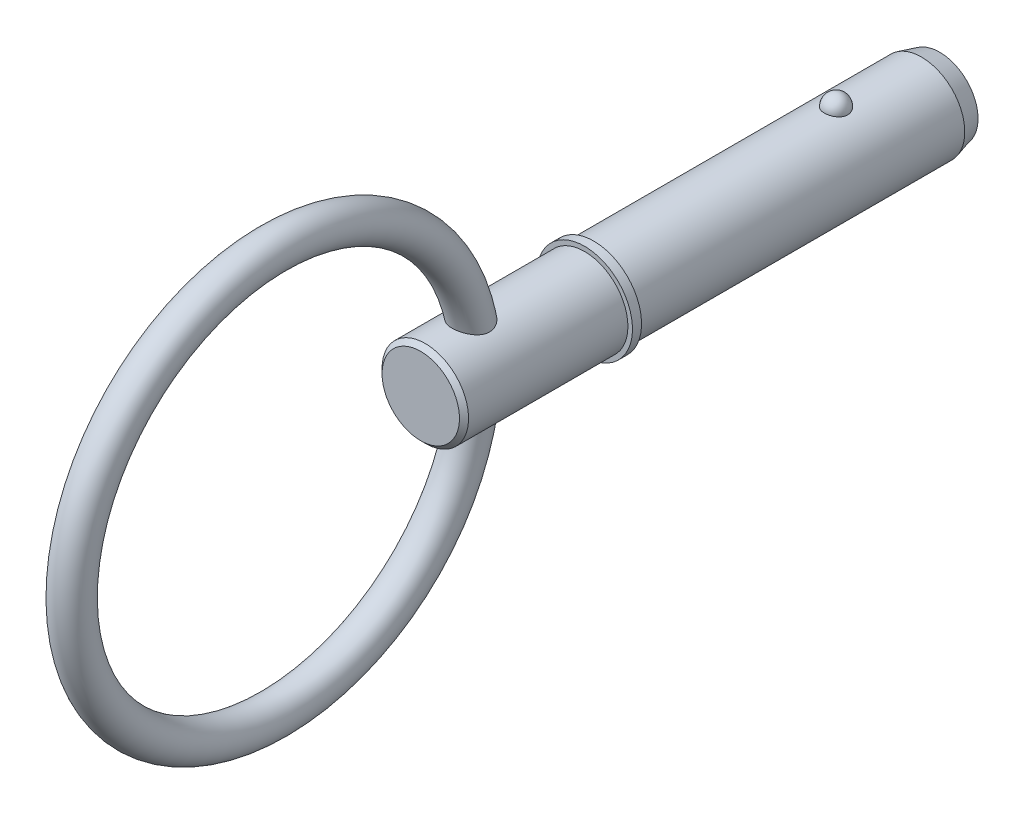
ISO-10303-21;
HEADER;
FILE_DESCRIPTION(('STEP AP214'),'2;1');
FILE_NAME('part.step','',(''),(''),'','','');
FILE_SCHEMA(('AUTOMOTIVE_DESIGN { 1 0 10303 214 1 1 1 1 }'));
ENDSEC;
DATA;
#1=APPLICATION_CONTEXT('core data for automotive mechanical design processes');
#2=APPLICATION_PROTOCOL_DEFINITION('international standard','automotive_design',2000,#1);
#3=PRODUCT_CONTEXT('',#1,'mechanical');
#4=PRODUCT('Part','Part','',(#3));
#5=PRODUCT_RELATED_PRODUCT_CATEGORY('part','',(#4));
#6=PRODUCT_DEFINITION_FORMATION('','',#4);
#7=PRODUCT_DEFINITION_CONTEXT('part definition',#1,'design');
#8=PRODUCT_DEFINITION('design','',#6,#7);
#9=PRODUCT_DEFINITION_SHAPE('','',#8);
#10=(LENGTH_UNIT() NAMED_UNIT(*) SI_UNIT(.MILLI.,.METRE.));
#11=(NAMED_UNIT(*) PLANE_ANGLE_UNIT() SI_UNIT($,.RADIAN.));
#12=(NAMED_UNIT(*) SI_UNIT($,.STERADIAN.) SOLID_ANGLE_UNIT());
#13=UNCERTAINTY_MEASURE_WITH_UNIT(LENGTH_MEASURE(1.E-05),#10,'distance_accuracy_value','');
#14=(GEOMETRIC_REPRESENTATION_CONTEXT(3) GLOBAL_UNCERTAINTY_ASSIGNED_CONTEXT((#13)) GLOBAL_UNIT_ASSIGNED_CONTEXT((#10,
#11,#12)) REPRESENTATION_CONTEXT('',''));
#15=CARTESIAN_POINT('',(0.,0.,0.));
#16=DIRECTION('',(0.,0.,1.));
#17=DIRECTION('',(1.,0.,0.));
#18=AXIS2_PLACEMENT_3D('',#15,#16,#17);
#19=CARTESIAN_POINT('',(0.,0.,25.4));
#20=DIRECTION('',(0.,0.,-1.));
#21=DIRECTION('',(-1.,0.,0.));
#22=AXIS2_PLACEMENT_3D('',#19,#20,#21);
#23=CYLINDRICAL_SURFACE('',#22,4.765);
#24=CARTESIAN_POINT('',(1.27812710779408,4.59038300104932,-1.29));
#25=CARTESIAN_POINT('',(1.27812572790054,4.59038414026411,-1.2178688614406));
#26=CARTESIAN_POINT('',(1.27223018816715,4.59203736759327,-1.14572000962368));
#27=CARTESIAN_POINT('',(1.24878929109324,4.59846646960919,-1.00346315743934));
#28=CARTESIAN_POINT('',(1.23123896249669,4.60324367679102,-0.933356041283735));
#29=CARTESIAN_POINT('',(1.18493861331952,4.61537801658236,-0.797215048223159));
#30=CARTESIAN_POINT('',(1.15619354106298,4.62273400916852,-0.731179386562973));
#31=CARTESIAN_POINT('',(1.08822596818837,4.6392032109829,-0.604986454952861));
#32=CARTESIAN_POINT('',(1.04900384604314,4.64831635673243,-0.544828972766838));
#33=CARTESIAN_POINT('',(0.960865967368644,4.66733302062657,-0.431775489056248));
#34=CARTESIAN_POINT('',(0.911906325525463,4.67723999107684,-0.378914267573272));
#35=CARTESIAN_POINT('',(0.805678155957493,4.69670280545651,-0.282245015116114));
#36=CARTESIAN_POINT('',(0.748409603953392,4.70625864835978,-0.238437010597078));
#37=CARTESIAN_POINT('',(0.627266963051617,4.72392767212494,-0.161207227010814));
#38=CARTESIAN_POINT('',(0.563411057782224,4.73204466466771,-0.127757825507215));
#39=CARTESIAN_POINT('',(0.430755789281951,4.74595788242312,-0.0720471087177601));
#40=CARTESIAN_POINT('',(0.361956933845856,4.75175434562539,-0.0497846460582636));
#41=CARTESIAN_POINT('',(0.222605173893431,4.76030056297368,-0.0173750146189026));
#42=CARTESIAN_POINT('',(0.152101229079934,4.76309991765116,-0.00703038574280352));
#43=CARTESIAN_POINT('',(0.0103009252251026,4.76551622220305,0.00191361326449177));
#44=CARTESIAN_POINT('',(-0.0609953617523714,4.76513345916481,0.00051404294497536));
#45=CARTESIAN_POINT('',(-0.201348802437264,4.76125496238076,-0.0138891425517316));
#46=CARTESIAN_POINT('',(-0.270423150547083,4.75780093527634,-0.026737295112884));
#47=CARTESIAN_POINT('',(-0.405377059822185,4.74820737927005,-0.0634598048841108));
#48=CARTESIAN_POINT('',(-0.471256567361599,4.74206780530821,-0.087334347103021));
#49=CARTESIAN_POINT('',(-0.598375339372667,4.72771507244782,-0.145611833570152));
#50=CARTESIAN_POINT('',(-0.659587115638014,4.71949070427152,-0.180071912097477));
#51=CARTESIAN_POINT('',(-0.775356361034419,4.70185936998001,-0.258542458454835));
#52=CARTESIAN_POINT('',(-0.8299131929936,4.69245229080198,-0.302553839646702));
#53=CARTESIAN_POINT('',(-0.931895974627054,4.67327936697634,-0.399829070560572));
#54=CARTESIAN_POINT('',(-0.979176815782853,4.66351011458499,-0.453244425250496));
#55=CARTESIAN_POINT('',(-1.06421220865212,4.64484426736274,-0.567321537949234));
#56=CARTESIAN_POINT('',(-1.10196613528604,4.63594772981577,-0.627983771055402));
#57=CARTESIAN_POINT('',(-1.16735225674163,4.61992036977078,-0.755585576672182));
#58=CARTESIAN_POINT('',(-1.19487251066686,4.61280933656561,-0.822585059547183));
#59=CARTESIAN_POINT('',(-1.23851975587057,4.60128324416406,-0.960417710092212));
#60=CARTESIAN_POINT('',(-1.25464705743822,4.59686811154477,-1.03125077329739));
#61=CARTESIAN_POINT('',(-1.27505790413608,4.59124882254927,-1.17443804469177));
#62=CARTESIAN_POINT('',(-1.27938868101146,4.59003186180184,-1.24678501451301));
#63=CARTESIAN_POINT('',(-1.27623192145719,4.5909105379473,-1.3911989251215));
#64=CARTESIAN_POINT('',(-1.26874468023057,4.59300609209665,-1.46326587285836));
#65=CARTESIAN_POINT('',(-1.24220427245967,4.60025423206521,-1.60473192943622));
#66=CARTESIAN_POINT('',(-1.2232043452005,4.60539274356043,-1.67414176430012));
#67=CARTESIAN_POINT('',(-1.17415910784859,4.61813957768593,-1.80870154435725));
#68=CARTESIAN_POINT('',(-1.1441133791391,4.62574799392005,-1.87385132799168));
#69=CARTESIAN_POINT('',(-1.07354327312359,4.64263368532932,-1.99841604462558));
#70=CARTESIAN_POINT('',(-1.03296580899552,4.65191934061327,-2.05779976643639));
#71=CARTESIAN_POINT('',(-0.942433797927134,4.67110036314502,-2.16881966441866));
#72=CARTESIAN_POINT('',(-0.892478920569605,4.68099575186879,-2.22045556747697));
#73=CARTESIAN_POINT('',(-0.784302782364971,4.70033161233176,-2.31471696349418));
#74=CARTESIAN_POINT('',(-0.726054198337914,4.70977043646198,-2.35731146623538));
#75=CARTESIAN_POINT('',(-0.602997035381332,4.72709995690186,-2.43206620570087));
#76=CARTESIAN_POINT('',(-0.538188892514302,4.73499075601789,-2.46422713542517));
#77=CARTESIAN_POINT('',(-0.404639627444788,4.7482563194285,-2.51687454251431));
#78=CARTESIAN_POINT('',(-0.335953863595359,4.7536596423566,-2.53749415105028));
#79=CARTESIAN_POINT('',(-0.195948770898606,4.76148510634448,-2.56703727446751));
#80=CARTESIAN_POINT('',(-0.124629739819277,4.76390758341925,-2.57596210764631));
#81=CARTESIAN_POINT('',(0.0172696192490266,4.76548774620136,-2.58180339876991));
#82=CARTESIAN_POINT('',(0.0878407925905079,4.76470225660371,-2.57892886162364));
#83=CARTESIAN_POINT('',(0.227467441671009,4.76008019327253,-2.56172603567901));
#84=CARTESIAN_POINT('',(0.296522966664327,4.75624371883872,-2.54739811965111));
#85=CARTESIAN_POINT('',(0.430942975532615,4.74595041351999,-2.50776251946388));
#86=CARTESIAN_POINT('',(0.496319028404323,4.7395023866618,-2.48249170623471));
#87=CARTESIAN_POINT('',(0.621860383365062,4.72467083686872,-2.4216730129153));
#88=CARTESIAN_POINT('',(0.682025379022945,4.71628720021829,-2.38612452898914));
#89=CARTESIAN_POINT('',(0.796409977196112,4.69833598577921,-2.30511163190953));
#90=CARTESIAN_POINT('',(0.850529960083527,4.68875291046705,-2.25951003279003));
#91=CARTESIAN_POINT('',(0.950412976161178,4.66953243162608,-2.15992428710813));
#92=CARTESIAN_POINT('',(0.996174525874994,4.65989501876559,-2.10593865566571));
#93=CARTESIAN_POINT('',(1.07885962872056,4.64145616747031,-1.99009376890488));
#94=CARTESIAN_POINT('',(1.11562789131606,4.63267081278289,-1.92812106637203));
#95=CARTESIAN_POINT('',(1.17840570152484,4.61710269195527,-1.79873681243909));
#96=CARTESIAN_POINT('',(1.20441973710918,4.61031909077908,-1.73132754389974));
#97=CARTESIAN_POINT('',(1.24242116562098,4.60021170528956,-1.60192906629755));
#98=CARTESIAN_POINT('',(1.25578772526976,4.59655387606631,-1.54036674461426));
#99=CARTESIAN_POINT('',(1.27364121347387,4.59163904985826,-1.41587409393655));
#100=CARTESIAN_POINT('',(1.2781283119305,4.59038200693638,-1.35294379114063));
#101=CARTESIAN_POINT('',(1.27812710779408,4.59038300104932,-1.29));
#102=B_SPLINE_CURVE_WITH_KNOTS('',3,(#24,#25,#26,#27,#28,#29,#30,#31,#32,#33,#34,#35,#36,#37,
#38,#39,#40,#41,#42,#43,#44,#45,#46,#47,#48,#49,#50,#51,#52,#53,#54,#55,#56,#57,#58,#59,#60,#61,
#62,#63,#64,#65,#66,#67,#68,#69,#70,#71,#72,#73,#74,#75,#76,#77,#78,#79,#80,#81,#82,#83,#84,#85,
#86,#87,#88,#89,#90,#91,#92,#93,#94,#95,#96,#97,#98,#99,#100,#101),.UNSPECIFIED.,.T.,.F.,(4,2,2,
2,2,2,2,2,2,2,2,2,2,2,2,2,2,2,2,2,2,2,2,2,2,2,2,2,2,2,2,2,2,2,2,2,2,2,4),(0.,0.216167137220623,
0.432426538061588,0.648590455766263,0.864746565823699,1.0818998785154,1.29905382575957,
1.51562361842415,1.73217119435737,1.94507683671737,2.15796327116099,2.36800220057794,
2.57804465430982,2.78924132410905,3.00045819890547,3.21545551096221,3.43046692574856,
3.64776550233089,3.8650581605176,4.08147951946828,4.29789547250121,4.51331818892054,
4.72874907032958,4.94528769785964,5.16183395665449,5.37911087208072,5.59637335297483,
5.8110751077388,6.02575265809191,6.23664413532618,6.44752874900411,6.65770827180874,
6.86790014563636,7.08116060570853,7.29445887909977,7.51121476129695,7.72788009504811,
7.91651762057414,8.10515153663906),.UNSPECIFIED.);
#103=CARTESIAN_POINT('',(1.27812710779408,4.59038300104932,-1.29));
#104=VERTEX_POINT('',#103);
#105=EDGE_CURVE('E101',#104,#104,#102,.T.);
#106=ORIENTED_EDGE('',*,*,#105,.T.);
#107=EDGE_LOOP('',(#106));
#108=FACE_BOUND('',#107,.T.);
#109=CARTESIAN_POINT('',(0.,0.,-10.7));
#110=DIRECTION('',(0.,0.,-1.));
#111=DIRECTION('',(-1.,0.,0.));
#112=AXIS2_PLACEMENT_3D('',#109,#110,#111);
#113=CIRCLE('',#112,4.765);
#114=CARTESIAN_POINT('',(-4.765,0.,-10.7));
#115=VERTEX_POINT('',#114);
#116=EDGE_CURVE('E109',#115,#115,#113,.F.);
#117=ORIENTED_EDGE('',*,*,#116,.T.);
#118=EDGE_LOOP('',(#117));
#119=FACE_BOUND('',#118,.T.);
#120=CARTESIAN_POINT('',(0.,0.,25.4));
#121=DIRECTION('',(0.,0.,1.));
#122=DIRECTION('',(1.,0.,0.));
#123=AXIS2_PLACEMENT_3D('',#120,#121,#122);
#124=CIRCLE('',#123,4.765);
#125=CARTESIAN_POINT('',(4.765,0.,25.4));
#126=VERTEX_POINT('',#125);
#127=EDGE_CURVE('E107',#126,#126,#124,.T.);
#128=ORIENTED_EDGE('',*,*,#127,.F.);
#129=EDGE_LOOP('',(#128));
#130=FACE_BOUND('',#129,.T.);
#131=ADVANCED_FACE('F39',(#108,#119,#130),#23,.T.);
#132=CARTESIAN_POINT('',(0.,0.,-12.7));
#133=DIRECTION('',(0.,0.,-1.));
#134=DIRECTION('',(-1.,0.,0.));
#135=AXIS2_PLACEMENT_3D('',#132,#133,#134);
#136=PLANE('',#135);
#137=CARTESIAN_POINT('',(0.,0.,-12.7));
#138=DIRECTION('',(0.,0.,-1.));
#139=DIRECTION('',(-1.,0.,0.));
#140=AXIS2_PLACEMENT_3D('',#137,#138,#139);
#141=CIRCLE('',#140,4.22910161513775);
#142=CARTESIAN_POINT('',(-4.22910161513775,0.,-12.7));
#143=VERTEX_POINT('',#142);
#144=EDGE_CURVE('E141',#143,#143,#141,.T.);
#145=ORIENTED_EDGE('',*,*,#144,.T.);
#146=EDGE_LOOP('',(#145));
#147=FACE_BOUND('',#146,.T.);
#148=ADVANCED_FACE('F87',(#147),#136,.T.);
#149=CARTESIAN_POINT('',(0.,0.,-12.7));
#150=DIRECTION('',(0.,0.,1.));
#151=DIRECTION('',(1.,0.,0.));
#152=AXIS2_PLACEMENT_3D('',#149,#150,#151);
#153=CONICAL_SURFACE('',#152,4.22910161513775,0.261799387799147);
#154=ORIENTED_EDGE('',*,*,#116,.F.);
#155=EDGE_LOOP('',(#154));
#156=FACE_BOUND('',#155,.T.);
#157=ORIENTED_EDGE('',*,*,#144,.F.);
#158=EDGE_LOOP('',(#157));
#159=FACE_BOUND('',#158,.T.);
#160=ADVANCED_FACE('F93',(#156,#159),#153,.T.);
#161=CARTESIAN_POINT('',(0.,4.765,-1.29));
#162=DIRECTION('',(0.,1.,0.));
#163=DIRECTION('',(0.,0.,-1.));
#164=AXIS2_PLACEMENT_3D('',#161,#162,#163);
#165=SPHERICAL_SURFACE('',#164,1.29);
#166=ORIENTED_EDGE('',*,*,#105,.F.);
#167=EDGE_LOOP('',(#166));
#168=FACE_BOUND('',#167,.T.);
#169=ADVANCED_FACE('F112',(#168),#165,.T.);
#170=CARTESIAN_POINT('',(0.,0.,25.4));
#171=DIRECTION('',(0.,0.,-1.));
#172=DIRECTION('',(-1.,0.,0.));
#173=AXIS2_PLACEMENT_3D('',#170,#171,#172);
#174=PLANE('',#173);
#175=ORIENTED_EDGE('',*,*,#127,.T.);
#176=EDGE_LOOP('',(#175));
#177=FACE_BOUND('',#176,.T.);
#178=CARTESIAN_POINT('',(0.,0.,25.4));
#179=DIRECTION('',(0.,0.,-1.));
#180=DIRECTION('',(-1.,0.,0.));
#181=AXIS2_PLACEMENT_3D('',#178,#179,#180);
#182=CIRCLE('',#181,5.265);
#183=CARTESIAN_POINT('',(-5.265,0.,25.4));
#184=VERTEX_POINT('',#183);
#185=EDGE_CURVE('E108',#184,#184,#182,.T.);
#186=ORIENTED_EDGE('',*,*,#185,.T.);
#187=EDGE_LOOP('',(#186));
#188=FACE_BOUND('',#187,.T.);
#189=ADVANCED_FACE('F116',(#177,#188),#174,.T.);
#190=CARTESIAN_POINT('',(0.,0.,33.7287874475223));
#191=DIRECTION('',(0.,0.,-1.));
#192=DIRECTION('',(-1.,0.,0.));
#193=AXIS2_PLACEMENT_3D('',#190,#191,#192);
#194=CYLINDRICAL_SURFACE('',#193,5.265);
#195=CARTESIAN_POINT('',(0.,0.,26.4));
#196=DIRECTION('',(0.,0.,-1.));
#197=DIRECTION('',(-1.,0.,0.));
#198=AXIS2_PLACEMENT_3D('',#195,#196,#197);
#199=CIRCLE('',#198,5.265);
#200=CARTESIAN_POINT('',(-5.265,0.,26.4));
#201=VERTEX_POINT('',#200);
#202=EDGE_CURVE('E133',#201,#201,#199,.T.);
#203=ORIENTED_EDGE('',*,*,#202,.T.);
#204=EDGE_LOOP('',(#203));
#205=FACE_BOUND('',#204,.T.);
#206=ORIENTED_EDGE('',*,*,#185,.F.);
#207=EDGE_LOOP('',(#206));
#208=FACE_BOUND('',#207,.T.);
#209=ADVANCED_FACE('F120',(#205,#208),#194,.T.);
#210=CARTESIAN_POINT('',(0.,5.265,26.4));
#211=DIRECTION('',(0.,0.,1.));
#212=DIRECTION('',(1.,0.,0.));
#213=AXIS2_PLACEMENT_3D('',#210,#211,#212);
#214=PLANE('',#213);
#215=CARTESIAN_POINT('',(0.,0.,26.4));
#216=DIRECTION('',(0.,0.,1.));
#217=DIRECTION('',(1.,0.,0.));
#218=AXIS2_PLACEMENT_3D('',#215,#216,#217);
#219=CIRCLE('',#218,4.765);
#220=CARTESIAN_POINT('',(4.765,0.,26.4));
#221=VERTEX_POINT('',#220);
#222=EDGE_CURVE('E111',#221,#221,#219,.T.);
#223=ORIENTED_EDGE('',*,*,#222,.F.);
#224=EDGE_LOOP('',(#223));
#225=FACE_BOUND('',#224,.T.);
#226=ORIENTED_EDGE('',*,*,#202,.F.);
#227=EDGE_LOOP('',(#226));
#228=FACE_BOUND('',#227,.T.);
#229=ADVANCED_FACE('F84',(#225,#228),#214,.T.);
#230=CARTESIAN_POINT('',(0.,0.,44.45));
#231=DIRECTION('',(0.,0.,-1.));
#232=DIRECTION('',(-1.,0.,0.));
#233=AXIS2_PLACEMENT_3D('',#230,#231,#232);
#234=CYLINDRICAL_SURFACE('',#233,4.765);
#235=CARTESIAN_POINT('',(-1.17603588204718,-4.61759294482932,37.2837200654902));
#236=CARTESIAN_POINT('',(-1.08605054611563,-4.6405075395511,37.2215688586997));
#237=CARTESIAN_POINT('',(-0.990486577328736,-4.66202408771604,37.1667393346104));
#238=CARTESIAN_POINT('',(-0.790762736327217,-4.70002969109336,37.0729957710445));
#239=CARTESIAN_POINT('',(-0.686587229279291,-4.7165093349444,37.0341114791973));
#240=CARTESIAN_POINT('',(-0.472539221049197,-4.7427361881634,36.973267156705));
#241=CARTESIAN_POINT('',(-0.362665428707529,-4.7524818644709,36.9513109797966));
#242=CARTESIAN_POINT('',(-0.140482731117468,-4.7642267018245,36.9249366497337));
#243=CARTESIAN_POINT('',(-0.0281752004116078,-4.7662301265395,36.9205088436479));
#244=CARTESIAN_POINT('',(0.193745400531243,-4.76233166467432,36.9292082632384));
#245=CARTESIAN_POINT('',(0.303372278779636,-4.75656024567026,36.9420457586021));
#246=CARTESIAN_POINT('',(0.518724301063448,-4.73791484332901,36.9844340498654));
#247=CARTESIAN_POINT('',(0.624448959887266,-4.72503997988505,37.0139869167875));
#248=CARTESIAN_POINT('',(0.829434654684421,-4.69340588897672,37.0892085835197));
#249=CARTESIAN_POINT('',(0.92867434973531,-4.6746283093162,37.1349277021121));
#250=CARTESIAN_POINT('',(1.11777413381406,-4.63305392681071,37.2414733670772));
#251=CARTESIAN_POINT('',(1.20763216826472,-4.61025624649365,37.3023032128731));
#252=CARTESIAN_POINT('',(1.37762760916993,-4.56238439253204,37.4394393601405));
#253=CARTESIAN_POINT('',(1.45749020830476,-4.53726959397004,37.5160728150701));
#254=CARTESIAN_POINT('',(1.60275140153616,-4.48801828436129,37.6822939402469));
#255=CARTESIAN_POINT('',(1.66815155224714,-4.46388166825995,37.771880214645));
#256=CARTESIAN_POINT('',(1.78162069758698,-4.41980966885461,37.9604689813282));
#257=CARTESIAN_POINT('',(1.82993675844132,-4.3998162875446,38.0593086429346));
#258=CARTESIAN_POINT('',(1.90902953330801,-4.36608532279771,38.2647395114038));
#259=CARTESIAN_POINT('',(1.93981696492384,-4.35234391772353,38.3713259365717));
#260=CARTESIAN_POINT('',(1.9818112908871,-4.33337618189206,38.5823805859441));
#261=CARTESIAN_POINT('',(1.99406945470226,-4.32769391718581,38.68660066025));
#262=CARTESIAN_POINT('',(2.0025484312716,-4.32377679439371,38.8958125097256));
#263=CARTESIAN_POINT('',(1.99876733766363,-4.32554282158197,39.0008043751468));
#264=CARTESIAN_POINT('',(1.97595504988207,-4.33600911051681,39.2091056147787));
#265=CARTESIAN_POINT('',(1.95686739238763,-4.3447350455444,39.3124073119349));
#266=CARTESIAN_POINT('',(1.90457346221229,-4.36790947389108,39.5146792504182));
#267=CARTESIAN_POINT('',(1.87136191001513,-4.38236010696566,39.6136478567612));
#268=CARTESIAN_POINT('',(1.78747856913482,-4.41728816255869,39.8164706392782));
#269=CARTESIAN_POINT('',(1.73524632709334,-4.43826528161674,39.9195927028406));
#270=CARTESIAN_POINT('',(1.61607256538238,-4.48303292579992,40.1163865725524));
#271=CARTESIAN_POINT('',(1.5491157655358,-4.50682636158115,40.2100484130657));
#272=CARTESIAN_POINT('',(1.39359064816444,-4.55746895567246,40.3953838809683));
#273=CARTESIAN_POINT('',(1.30346928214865,-4.58437060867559,40.4857503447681));
#274=CARTESIAN_POINT('',(1.10794390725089,-4.6354985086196,40.6490111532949));
#275=CARTESIAN_POINT('',(1.00255934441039,-4.65972809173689,40.7219274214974));
#276=CARTESIAN_POINT('',(0.803761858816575,-4.69755503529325,40.8324077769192));
#277=CARTESIAN_POINT('',(0.712935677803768,-4.71231838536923,40.8742306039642));
#278=CARTESIAN_POINT('',(0.525172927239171,-4.73691370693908,40.9429362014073));
#279=CARTESIAN_POINT('',(0.428242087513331,-4.7467502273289,40.9698327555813));
#280=CARTESIAN_POINT('',(0.230351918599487,-4.76046566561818,41.0071470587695));
#281=CARTESIAN_POINT('',(0.129376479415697,-4.76431768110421,41.0174904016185));
#282=CARTESIAN_POINT('',(-0.0728965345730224,-4.76551495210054,41.0207168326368));
#283=CARTESIAN_POINT('',(-0.174194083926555,-4.76286070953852,41.0136012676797));
#284=CARTESIAN_POINT('',(-0.366467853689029,-4.751792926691,40.9835798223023));
#285=CARTESIAN_POINT('',(-0.457659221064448,-4.74381187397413,40.9618588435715));
#286=CARTESIAN_POINT('',(-0.63522668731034,-4.72331548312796,40.9050844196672));
#287=CARTESIAN_POINT('',(-0.721601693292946,-4.71079912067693,40.8700279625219));
#288=CARTESIAN_POINT('',(-0.893212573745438,-4.68139468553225,40.7855597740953));
#289=CARTESIAN_POINT('',(-0.978027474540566,-4.66427939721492,40.7353775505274));
#290=CARTESIAN_POINT('',(-1.13917803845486,-4.62756330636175,40.6236420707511));
#291=CARTESIAN_POINT('',(-1.21550961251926,-4.60796131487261,40.5620833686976));
#292=CARTESIAN_POINT('',(-1.37033540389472,-4.56452178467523,40.4186885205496));
#293=CARTESIAN_POINT('',(-1.44723650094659,-4.5405070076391,40.3351843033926));
#294=CARTESIAN_POINT('',(-1.587638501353,-4.49334232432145,40.1572920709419));
#295=CARTESIAN_POINT('',(-1.65112672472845,-4.47019325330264,40.0628938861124));
#296=CARTESIAN_POINT('',(-1.77033243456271,-4.42444393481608,39.8532060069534));
#297=CARTESIAN_POINT('',(-1.82420433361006,-4.40224259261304,39.7367685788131));
#298=CARTESIAN_POINT('',(-1.91169086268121,-4.36496831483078,39.4954090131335));
#299=CARTESIAN_POINT('',(-1.94531523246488,-4.34989195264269,39.3704909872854));
#300=CARTESIAN_POINT('',(-1.98892523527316,-4.33012255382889,39.1220163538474));
#301=CARTESIAN_POINT('',(-1.99998275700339,-4.32495941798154,38.9986899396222));
#302=CARTESIAN_POINT('',(-2.00001713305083,-4.32494814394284,38.7520738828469));
#303=CARTESIAN_POINT('',(-1.98902141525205,-4.33008719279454,38.6287843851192));
#304=CARTESIAN_POINT('',(-1.94752572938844,-4.34888267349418,38.4032137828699));
#305=CARTESIAN_POINT('',(-1.91979754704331,-4.36132278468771,38.3003106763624));
#306=CARTESIAN_POINT('',(-1.84805595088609,-4.39220107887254,38.1012512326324));
#307=CARTESIAN_POINT('',(-1.80403476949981,-4.4106421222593,38.0050981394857));
#308=CARTESIAN_POINT('',(-1.70232000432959,-4.4508689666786,37.8244579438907));
#309=CARTESIAN_POINT('',(-1.64499853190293,-4.47255887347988,37.7397380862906));
#310=CARTESIAN_POINT('',(-1.51770958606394,-4.51733419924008,37.5810122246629));
#311=CARTESIAN_POINT('',(-1.44776268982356,-4.54041730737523,37.5069891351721));
#312=CARTESIAN_POINT('',(-1.34143544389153,-4.57239833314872,37.41104340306));
#313=CARTESIAN_POINT('',(-1.30955259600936,-4.58164274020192,37.3841153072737));
#314=CARTESIAN_POINT('',(-1.24406394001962,-4.59985727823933,37.3323409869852));
#315=CARTESIAN_POINT('',(-1.21045807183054,-4.6088273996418,37.3074948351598));
#316=CARTESIAN_POINT('',(-1.17603588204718,-4.61759294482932,37.2837200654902));
#317=B_SPLINE_CURVE_WITH_KNOTS('',3,(#235,#236,#237,#238,#239,#240,#241,#242,#243,#244,#245,
#246,#247,#248,#249,#250,#251,#252,#253,#254,#255,#256,#257,#258,#259,#260,#261,#262,#263,#264,
#265,#266,#267,#268,#269,#270,#271,#272,#273,#274,#275,#276,#277,#278,#279,#280,#281,#282,#283,
#284,#285,#286,#287,#288,#289,#290,#291,#292,#293,#294,#295,#296,#297,#298,#299,#300,#301,#302,
#303,#304,#305,#306,#307,#308,#309,#310,#311,#312,#313,#314,#315,#316),.UNSPECIFIED.,.T.,.F.,(4,
2,2,2,2,2,2,2,2,2,2,2,2,2,2,2,2,2,2,2,2,2,2,2,2,2,2,2,2,2,2,2,2,2,2,2,2,2,2,2,4),(0.,
0.335054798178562,0.670731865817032,1.00648532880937,1.34205386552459,1.67206089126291,
2.00210881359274,2.33319321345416,2.66434996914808,3.00321157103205,3.34203668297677,
3.67573940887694,4.0092378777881,4.32299322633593,4.6367858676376,4.95174139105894,
5.26681474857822,5.6178575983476,5.96926647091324,6.35862694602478,6.74749565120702,
7.04947204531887,7.35116911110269,7.65421852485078,7.95724456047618,8.23825252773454,
8.51932400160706,8.81825171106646,9.11732288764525,9.46404422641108,9.81109188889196,
10.1997682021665,10.5882573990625,10.9578189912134,11.32692124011,11.6472091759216,
11.9676500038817,12.2800235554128,12.5918925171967,12.7200569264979,12.8482258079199),.UNSPECIFIED.);
#318=CARTESIAN_POINT('',(-1.17603588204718,-4.61759294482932,37.2837200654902));
#319=VERTEX_POINT('',#318);
#320=EDGE_CURVE('E10',#319,#319,#317,.T.);
#321=ORIENTED_EDGE('',*,*,#320,.F.);
#322=EDGE_LOOP('',(#321));
#323=FACE_BOUND('',#322,.T.);
#324=CARTESIAN_POINT('',(-1.17603588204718,4.61759294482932,37.2837200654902));
#325=CARTESIAN_POINT('',(-1.26499234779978,4.59493450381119,37.3451699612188));
#326=CARTESIAN_POINT('',(-1.34870034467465,4.57085993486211,37.4139152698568));
#327=CARTESIAN_POINT('',(-1.50334626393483,4.52236448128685,37.564635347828));
#328=CARTESIAN_POINT('',(-1.57425996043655,4.49794303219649,37.6466346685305));
#329=CARTESIAN_POINT('',(-1.7013018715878,4.45144771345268,37.8222345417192));
#330=CARTESIAN_POINT('',(-1.75740699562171,4.42937754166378,37.9158528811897));
#331=CARTESIAN_POINT('',(-1.85287755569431,4.39030189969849,38.1121668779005));
#332=CARTESIAN_POINT('',(-1.89225871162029,4.37329167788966,38.2148539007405));
#333=CARTESIAN_POINT('',(-1.95188661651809,4.34699775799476,38.4218576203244));
#334=CARTESIAN_POINT('',(-1.97286468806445,4.33742068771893,38.5259265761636));
#335=CARTESIAN_POINT('',(-1.99814509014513,4.32583397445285,38.7364714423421));
#336=CARTESIAN_POINT('',(-2.00244696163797,4.32382453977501,38.8429474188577));
#337=CARTESIAN_POINT('',(-1.99499900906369,4.32726361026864,39.0527706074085));
#338=CARTESIAN_POINT('',(-1.9836061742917,4.33254625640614,39.156134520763));
#339=CARTESIAN_POINT('',(-1.94643618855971,4.34936983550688,39.3596911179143));
#340=CARTESIAN_POINT('',(-1.92065444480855,4.3609127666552,39.4598827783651));
#341=CARTESIAN_POINT('',(-1.85292379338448,4.3901452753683,39.6641042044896));
#342=CARTESIAN_POINT('',(-1.80971134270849,4.40830066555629,39.7676462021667));
#343=CARTESIAN_POINT('',(-1.70892742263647,4.44833985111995,39.9667684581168));
#344=CARTESIAN_POINT('',(-1.65134284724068,4.47022704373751,40.0623413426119));
#345=CARTESIAN_POINT('',(-1.51475300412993,4.51847764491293,40.2552600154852));
#346=CARTESIAN_POINT('',(-1.43395667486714,4.54505660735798,40.3512914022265));
#347=CARTESIAN_POINT('',(-1.25684082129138,4.59718102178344,40.5281328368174));
#348=CARTESIAN_POINT('',(-1.1605312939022,4.62272712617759,40.6089526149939));
#349=CARTESIAN_POINT('',(-0.972192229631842,4.66558476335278,40.7393265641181));
#350=CARTESIAN_POINT('',(-0.882391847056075,4.68355428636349,40.7918799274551));
#351=CARTESIAN_POINT('',(-0.694836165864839,4.71502283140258,40.8820221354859));
#352=CARTESIAN_POINT('',(-0.597087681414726,4.72852563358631,40.9196236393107));
#353=CARTESIAN_POINT('',(-0.395321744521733,4.74966109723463,40.9778751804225));
#354=CARTESIAN_POINT('',(-0.291269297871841,4.75725698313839,40.9984190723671));
#355=CARTESIAN_POINT('',(-0.080897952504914,4.76547327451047,41.0206246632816));
#356=CARTESIAN_POINT('',(0.0254198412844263,4.76609700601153,41.0222953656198));
#357=CARTESIAN_POINT('',(0.225327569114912,4.7606097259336,41.0074850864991));
#358=CARTESIAN_POINT('',(0.31908414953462,4.75519734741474,40.9928871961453));
#359=CARTESIAN_POINT('',(0.502750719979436,4.73930039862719,40.9493972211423));
#360=CARTESIAN_POINT('',(0.592660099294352,4.72881502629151,40.920502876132));
#361=CARTESIAN_POINT('',(0.768777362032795,4.70343779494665,40.8490413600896));
#362=CARTESIAN_POINT('',(0.854839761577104,4.68844387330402,40.8061552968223));
#363=CARTESIAN_POINT('',(1.01943666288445,4.65543047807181,40.7087469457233));
#364=CARTESIAN_POINT('',(1.09796821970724,4.63740982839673,40.6542201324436));
#365=CARTESIAN_POINT('',(1.25751825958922,4.59691257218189,40.5264656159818));
#366=CARTESIAN_POINT('',(1.33721103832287,4.57417011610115,40.4516678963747));
#367=CARTESIAN_POINT('',(1.48461190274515,4.52847869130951,40.2910829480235));
#368=CARTESIAN_POINT('',(1.55230949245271,4.50552956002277,40.2052862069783));
#369=CARTESIAN_POINT('',(1.68366050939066,4.45825797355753,40.0114045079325));
#370=CARTESIAN_POINT('',(1.74532014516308,4.4342153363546,39.9018899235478));
#371=CARTESIAN_POINT('',(1.85007805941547,4.39154308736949,39.6732696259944));
#372=CARTESIAN_POINT('',(1.89317429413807,4.37291407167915,39.5541628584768));
#373=CARTESIAN_POINT('',(1.958572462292,4.34402041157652,39.3097631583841));
#374=CARTESIAN_POINT('',(1.98095022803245,4.33372528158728,39.184494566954));
#375=CARTESIAN_POINT('',(2.00301292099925,4.32358016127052,38.9315942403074));
#376=CARTESIAN_POINT('',(2.00273000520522,4.32371536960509,38.8039661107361));
#377=CARTESIAN_POINT('',(1.97997568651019,4.3341693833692,38.5682474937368));
#378=CARTESIAN_POINT('',(1.96044562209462,4.34313814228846,38.4598066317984));
#379=CARTESIAN_POINT('',(1.90368145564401,4.36831534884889,38.2485431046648));
#380=CARTESIAN_POINT('',(1.86644884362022,4.38452318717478,38.1457199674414));
#381=CARTESIAN_POINT('',(1.77811542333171,4.42104679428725,37.9547100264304));
#382=CARTESIAN_POINT('',(1.72797707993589,4.44105894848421,37.8660156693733));
#383=CARTESIAN_POINT('',(1.61439500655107,4.48359504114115,37.6982868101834));
#384=CARTESIAN_POINT('',(1.55094927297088,4.50611935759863,37.6192537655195));
#385=CARTESIAN_POINT('',(1.40889349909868,4.55259151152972,37.4687053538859));
#386=CARTESIAN_POINT('',(1.32968750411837,4.57655455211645,37.3977571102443));
#387=CARTESIAN_POINT('',(1.16035884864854,4.62238936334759,37.2695060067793));
#388=CARTESIAN_POINT('',(1.070233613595,4.64426063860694,37.2122063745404));
#389=CARTESIAN_POINT('',(0.877362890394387,4.68460759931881,37.1103166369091));
#390=CARTESIAN_POINT('',(0.774249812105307,4.70290564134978,37.0663495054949));
#391=CARTESIAN_POINT('',(0.561430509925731,4.73302876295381,36.9954843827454));
#392=CARTESIAN_POINT('',(0.45172542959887,4.74485496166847,36.9685834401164));
#393=CARTESIAN_POINT('',(0.230282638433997,4.76071009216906,36.9327633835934));
#394=CARTESIAN_POINT('',(0.118587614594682,4.76483485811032,36.9236232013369));
#395=CARTESIAN_POINT('',(-0.104911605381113,4.76515532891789,36.9229082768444));
#396=CARTESIAN_POINT('',(-0.216715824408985,4.76134861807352,36.9313388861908));
#397=CARTESIAN_POINT('',(-0.435231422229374,4.74632552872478,36.9652456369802));
#398=CARTESIAN_POINT('',(-0.541996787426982,4.73523460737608,36.9904332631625));
#399=CARTESIAN_POINT('',(-0.749371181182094,4.70686626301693,37.0569215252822));
#400=CARTESIAN_POINT('',(-0.849990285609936,4.68959930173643,37.0981949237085));
#401=CARTESIAN_POINT('',(-0.986108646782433,4.6620261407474,37.1672359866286));
#402=CARTESIAN_POINT('',(-1.02525769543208,4.65355983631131,37.1887724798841));
#403=CARTESIAN_POINT('',(-1.10191286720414,4.63600664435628,37.2343673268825));
#404=CARTESIAN_POINT('',(-1.13941901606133,4.62691976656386,37.258425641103));
#405=CARTESIAN_POINT('',(-1.17603588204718,4.61759294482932,37.2837200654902));
#406=B_SPLINE_CURVE_WITH_KNOTS('',3,(#324,#325,#326,#327,#328,#329,#330,#331,#332,#333,#334,
#335,#336,#337,#338,#339,#340,#341,#342,#343,#344,#345,#346,#347,#348,#349,#350,#351,#352,#353,
#354,#355,#356,#357,#358,#359,#360,#361,#362,#363,#364,#365,#366,#367,#368,#369,#370,#371,#372,
#373,#374,#375,#376,#377,#378,#379,#380,#381,#382,#383,#384,#385,#386,#387,#388,#389,#390,#391,
#392,#393,#394,#395,#396,#397,#398,#399,#400,#401,#402,#403,#404,#405),.UNSPECIFIED.,.T.,.F.,(4,
2,2,2,2,2,2,2,2,2,2,2,2,2,2,2,2,2,2,2,2,2,2,2,2,2,2,2,2,2,2,2,2,2,2,2,2,2,2,2,4),(0.,
0.331234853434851,0.66309046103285,0.995460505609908,1.3275174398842,1.64568783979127,
1.96386699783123,2.2749271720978,2.58608669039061,2.92571998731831,3.26566413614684,
3.64875195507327,4.03159388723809,4.34706664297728,4.66227172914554,4.97942386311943,
5.29642469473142,5.58021908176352,5.86405835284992,6.15488068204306,6.44581627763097,
6.77943874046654,7.11335170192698,7.49545660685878,7.87760356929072,8.25834622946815,
8.63854860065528,8.96843568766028,9.29829501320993,9.60842872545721,9.91860916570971,
10.2441707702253,10.5698092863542,10.9089029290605,11.2479379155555,11.5827251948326,
11.9176144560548,12.2468820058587,12.5755944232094,12.7119417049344,12.8482868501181),.UNSPECIFIED.);
#407=CARTESIAN_POINT('',(-1.17603588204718,4.61759294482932,37.2837200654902));
#408=VERTEX_POINT('',#407);
#409=EDGE_CURVE('E51',#408,#408,#406,.T.);
#410=ORIENTED_EDGE('',*,*,#409,.F.);
#411=EDGE_LOOP('',(#410));
#412=FACE_BOUND('',#411,.T.);
#413=CARTESIAN_POINT('',(0.,0.,43.95));
#414=DIRECTION('',(0.,0.,-1.));
#415=DIRECTION('',(-1.,0.,0.));
#416=AXIS2_PLACEMENT_3D('',#413,#414,#415);
#417=CIRCLE('',#416,4.765);
#418=CARTESIAN_POINT('',(-4.765,0.,43.95));
#419=VERTEX_POINT('',#418);
#420=EDGE_CURVE('E63',#419,#419,#417,.T.);
#421=ORIENTED_EDGE('',*,*,#420,.T.);
#422=EDGE_LOOP('',(#421));
#423=FACE_BOUND('',#422,.T.);
#424=ORIENTED_EDGE('',*,*,#222,.T.);
#425=EDGE_LOOP('',(#424));
#426=FACE_BOUND('',#425,.T.);
#427=ADVANCED_FACE('F68',(#323,#412,#423,#426),#234,.T.);
#428=CARTESIAN_POINT('',(0.,0.,44.45));
#429=DIRECTION('',(0.,0.,-1.));
#430=DIRECTION('',(-1.,0.,0.));
#431=AXIS2_PLACEMENT_3D('',#428,#429,#430);
#432=PLANE('',#431);
#433=CARTESIAN_POINT('',(0.,0.,44.45));
#434=DIRECTION('',(0.,0.,-1.));
#435=DIRECTION('',(-1.,0.,0.));
#436=AXIS2_PLACEMENT_3D('',#433,#434,#435);
#437=CIRCLE('',#436,4.26499999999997);
#438=CARTESIAN_POINT('',(-4.26499999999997,0.,44.45));
#439=VERTEX_POINT('',#438);
#440=EDGE_CURVE('E57',#439,#439,#437,.F.);
#441=ORIENTED_EDGE('',*,*,#440,.T.);
#442=EDGE_LOOP('',(#441));
#443=FACE_BOUND('',#442,.T.);
#444=ADVANCED_FACE('F75',(#443),#432,.F.);
#445=CARTESIAN_POINT('',(0.,0.,43.95));
#446=DIRECTION('',(0.,0.,-1.));
#447=DIRECTION('',(-1.,0.,0.));
#448=AXIS2_PLACEMENT_3D('',#445,#446,#447);
#449=CONICAL_SURFACE('',#448,4.765,0.785398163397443);
#450=ORIENTED_EDGE('',*,*,#440,.F.);
#451=EDGE_LOOP('',(#450));
#452=FACE_BOUND('',#451,.T.);
#453=ORIENTED_EDGE('',*,*,#420,.F.);
#454=EDGE_LOOP('',(#453));
#455=FACE_BOUND('',#454,.T.);
#456=ADVANCED_FACE('F41',(#452,#455),#449,.T.);
#457=CARTESIAN_POINT('',(0.,0.,60.675));
#458=DIRECTION('',(1.,0.,0.));
#459=DIRECTION('',(0.,0.,-1.));
#460=AXIS2_PLACEMENT_3D('',#457,#458,#459);
#461=TOROIDAL_SURFACE('',#460,22.225,2.);
#462=ORIENTED_EDGE('',*,*,#320,.T.);
#463=EDGE_LOOP('',(#462));
#464=FACE_BOUND('',#463,.T.);
#465=ORIENTED_EDGE('',*,*,#409,.T.);
#466=EDGE_LOOP('',(#465));
#467=FACE_BOUND('',#466,.T.);
#468=ADVANCED_FACE('F72',(#464,#467),#461,.T.);
#469=CLOSED_SHELL('',(#131,#148,#160,#169,#189,#209,#229,#427,#444,#456,#468));
#470=MANIFOLD_SOLID_BREP('B2',#469);
#471=ADVANCED_BREP_SHAPE_REPRESENTATION('',(#18,#470),#14);
#472=SHAPE_DEFINITION_REPRESENTATION(#9,#471);
ENDSEC;
END-ISO-10303-21;
